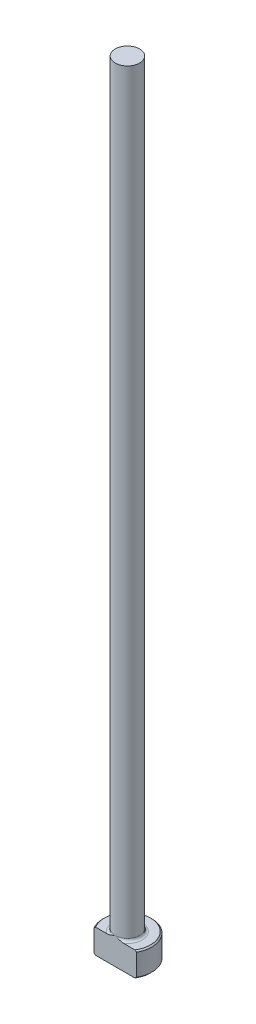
from build123d import *

# Parameters (mm, degrees)
CHAMFER1_SIZE = 0.254
FILLET1_R     = 0.508
KEY_DEPTH     = 153.548755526


with BuildPart() as part:
    # Sketch1 → Revolve1 (revolve)
    with BuildSketch(Plane.XY, mode=Mode.PRIVATE) as revolve1_sk:
        Polygon((0, 0), (-4.7625, 0), (-4.7625, 4.7498), (-2.38125, 4.7498), (-2.38125, 152.4), (0, 152.4), align=None)
    revolve(revolve1_sk.sketch.rotate(Axis((0, 259.958771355, 0), (0, -1, 0)), 270), axis=Axis((0, 259.958771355, 0), (0, -1, 0)))

    # Chamfer1
    chamfer1_edges = [part.edges().sort_by_distance(p)[0] for p in [
        (0, 4.7498, -4.7625),
        (0, 0, -4.7625),
    ]]
    chamfer(chamfer1_edges, length=CHAMFER1_SIZE)

    # Fillet1
    fillet1_edges = [part.edges().sort_by_distance(p)[0] for p in [
        (0, 4.7498, -2.38125),
    ]]
    fillet(fillet1_edges, radius=FILLET1_R)

    # Sketch2 → Key (cut, through all)
    with BuildSketch(Plane(origin=(0, 0, 0), x_dir=(1, 0, 0), z_dir=(0, 1, 0))):
        with BuildLine():
            Line((-4.124445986, -2.38125), (4.124445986, -2.38125))
            ThreePointArc((4.124445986, -2.38125), (0, -4.7625), (-4.124445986, -2.38125))
        make_face()
    extrude(amount=KEY_DEPTH, mode=Mode.SUBTRACT)


solid = part.part
